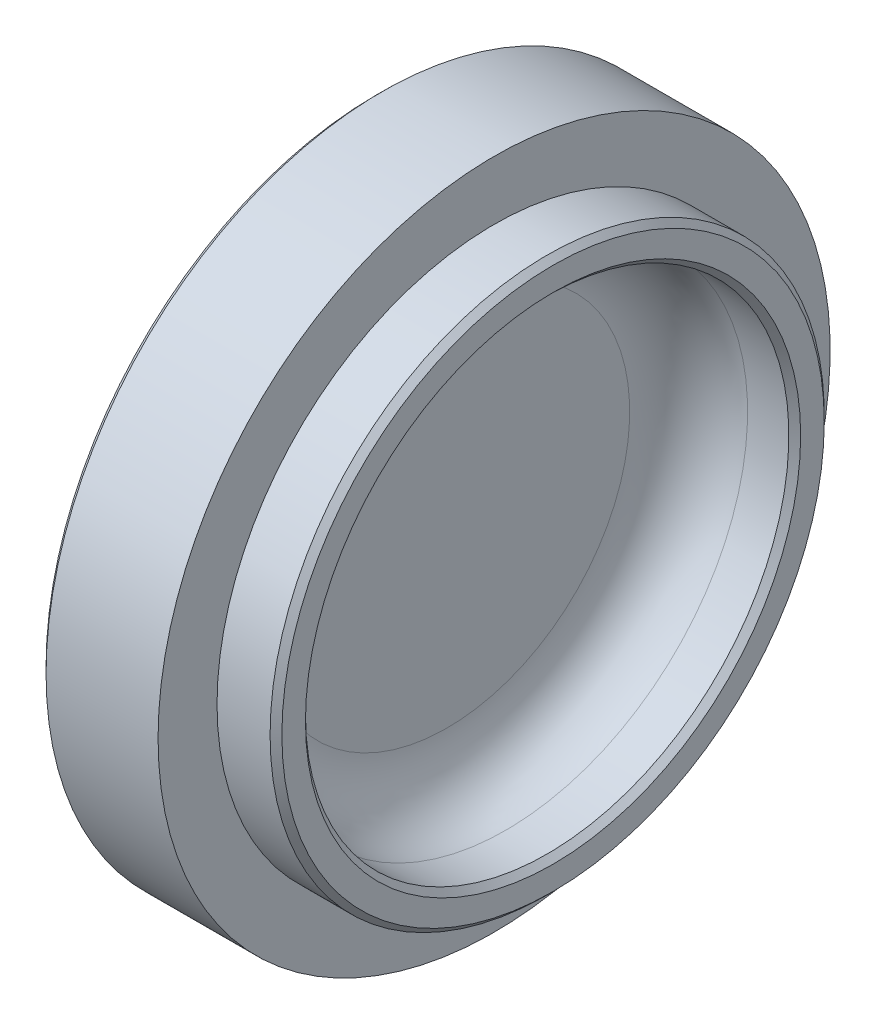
from build123d import *

# Parameters (mm, degrees)
CHANFREIN1_SIZE = 0.5


with BuildPart() as part:
    # Esquisse1 → R_volution1 (revolve)
    with BuildSketch(Plane.XY, mode=Mode.PRIVATE) as r_volution1_sk:
        with BuildLine():
            Line((0, 0), (0, 28.5))
            Line((0, 28.5), (10, 28.5))
            Line((10, 28.5), (10, 23.5))
            Line((10, 23.5), (15, 23.5))
            Line((15, 23.5), (15, 20.5))
            Line((15, 20.5), (11, 20.5))
            ThreePointArc((11, 20.5), (7.464466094, 19.035533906), (6, 15.5))
            Line((6, 15.5), (6, 0))
            Line((6, 0), (0, 0))
        make_face()
    revolve(r_volution1_sk.sketch.rotate(Axis((0, 0, 0), (1, 0, 0)), 90), axis=Axis((0, 0, 0), (1, 0, 0)))

    # Chanfrein1
    chanfrein1_edges = [part.edges().sort_by_distance(p)[0] for p in [
        (15, 0, -20.5),
        (15, 0, -23.5),
        (0, 0, -28.5),
    ]]
    chamfer(chanfrein1_edges, length=CHANFREIN1_SIZE)


solid = part.part
